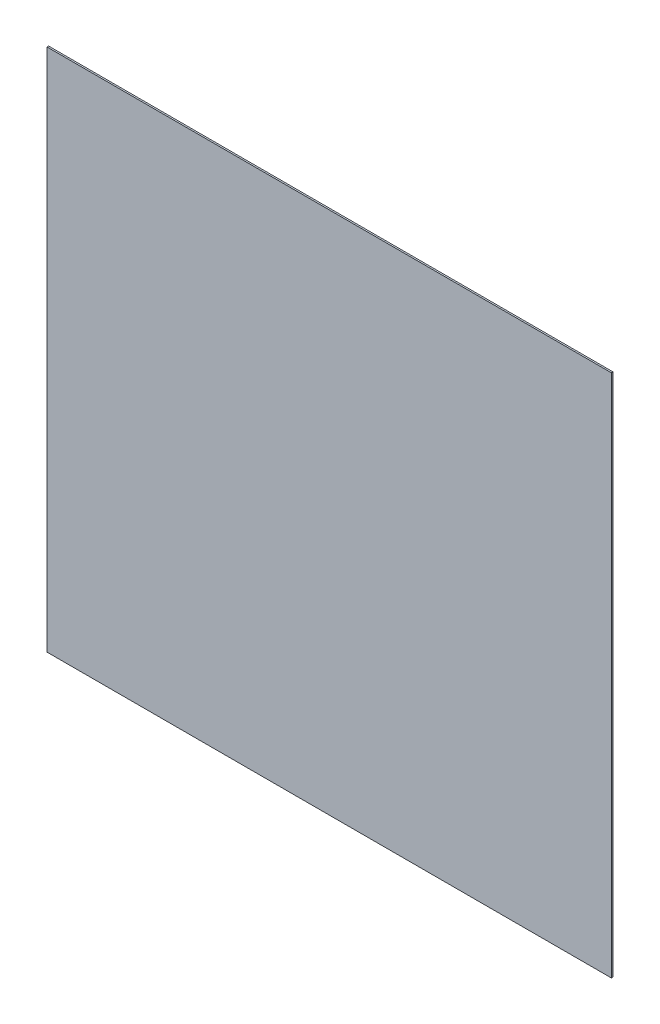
ISO-10303-21;
HEADER;
FILE_DESCRIPTION(('STEP AP214'),'2;1');
FILE_NAME('part.step','',(''),(''),'','','');
FILE_SCHEMA(('AUTOMOTIVE_DESIGN { 1 0 10303 214 1 1 1 1 }'));
ENDSEC;
DATA;
#1=APPLICATION_CONTEXT('core data for automotive mechanical design processes');
#2=APPLICATION_PROTOCOL_DEFINITION('international standard','automotive_design',2000,#1);
#3=PRODUCT_CONTEXT('',#1,'mechanical');
#4=PRODUCT('Part','Part','',(#3));
#5=PRODUCT_RELATED_PRODUCT_CATEGORY('part','',(#4));
#6=PRODUCT_DEFINITION_FORMATION('','',#4);
#7=PRODUCT_DEFINITION_CONTEXT('part definition',#1,'design');
#8=PRODUCT_DEFINITION('design','',#6,#7);
#9=PRODUCT_DEFINITION_SHAPE('','',#8);
#10=(LENGTH_UNIT() NAMED_UNIT(*) SI_UNIT(.MILLI.,.METRE.));
#11=(NAMED_UNIT(*) PLANE_ANGLE_UNIT() SI_UNIT($,.RADIAN.));
#12=(NAMED_UNIT(*) SI_UNIT($,.STERADIAN.) SOLID_ANGLE_UNIT());
#13=UNCERTAINTY_MEASURE_WITH_UNIT(LENGTH_MEASURE(1.E-05),#10,'distance_accuracy_value','');
#14=(GEOMETRIC_REPRESENTATION_CONTEXT(3) GLOBAL_UNCERTAINTY_ASSIGNED_CONTEXT((#13)) GLOBAL_UNIT_ASSIGNED_CONTEXT((#10,
#11,#12)) REPRESENTATION_CONTEXT('',''));
#15=CARTESIAN_POINT('',(0.,0.,0.));
#16=DIRECTION('',(0.,0.,1.));
#17=DIRECTION('',(1.,0.,0.));
#18=AXIS2_PLACEMENT_3D('',#15,#16,#17);
#19=CARTESIAN_POINT('',(0.,0.,2.));
#20=DIRECTION('',(1.,0.,0.));
#21=DIRECTION('',(0.,0.,-1.));
#22=AXIS2_PLACEMENT_3D('',#19,#20,#21);
#23=PLANE('',#22);
#24=DIRECTION('',(0.,-1.,0.));
#25=VECTOR('',#24,1.);
#26=CARTESIAN_POINT('',(0.,0.,0.));
#27=LINE('',#26,#25);
#28=CARTESIAN_POINT('',(0.,650.,0.));
#29=VERTEX_POINT('',#28);
#30=CARTESIAN_POINT('',(0.,0.,0.));
#31=VERTEX_POINT('',#30);
#32=EDGE_CURVE('E95',#29,#31,#27,.T.);
#33=ORIENTED_EDGE('',*,*,#32,.T.);
#34=DIRECTION('',(0.,0.,-1.));
#35=VECTOR('',#34,1.);
#36=CARTESIAN_POINT('',(0.,0.,2.));
#37=LINE('',#36,#35);
#38=CARTESIAN_POINT('',(0.,0.,2.));
#39=VERTEX_POINT('',#38);
#40=EDGE_CURVE('E11',#39,#31,#37,.T.);
#41=ORIENTED_EDGE('',*,*,#40,.F.);
#42=DIRECTION('',(0.,-1.,0.));
#43=VECTOR('',#42,1.);
#44=CARTESIAN_POINT('',(0.,0.,2.));
#45=LINE('',#44,#43);
#46=CARTESIAN_POINT('',(0.,650.,2.));
#47=VERTEX_POINT('',#46);
#48=EDGE_CURVE('E83',#47,#39,#45,.T.);
#49=ORIENTED_EDGE('',*,*,#48,.F.);
#50=DIRECTION('',(0.,0.,-1.));
#51=VECTOR('',#50,1.);
#52=CARTESIAN_POINT('',(0.,650.,2.));
#53=LINE('',#52,#51);
#54=EDGE_CURVE('E91',#47,#29,#53,.T.);
#55=ORIENTED_EDGE('',*,*,#54,.T.);
#56=EDGE_LOOP('',(#33,#41,#49,#55));
#57=FACE_BOUND('',#56,.T.);
#58=ADVANCED_FACE('F32',(#57),#23,.F.);
#59=CARTESIAN_POINT('',(0.,0.,2.));
#60=DIRECTION('',(0.,1.,0.));
#61=DIRECTION('',(0.,0.,1.));
#62=AXIS2_PLACEMENT_3D('',#59,#60,#61);
#63=PLANE('',#62);
#64=DIRECTION('',(1.,0.,0.));
#65=VECTOR('',#64,1.);
#66=CARTESIAN_POINT('',(0.,0.,0.));
#67=LINE('',#66,#65);
#68=CARTESIAN_POINT('',(700.,0.,0.));
#69=VERTEX_POINT('',#68);
#70=EDGE_CURVE('E87',#31,#69,#67,.T.);
#71=ORIENTED_EDGE('',*,*,#70,.T.);
#72=DIRECTION('',(0.,0.,-1.));
#73=VECTOR('',#72,1.);
#74=CARTESIAN_POINT('',(700.,0.,2.));
#75=LINE('',#74,#73);
#76=CARTESIAN_POINT('',(700.,0.,2.));
#77=VERTEX_POINT('',#76);
#78=EDGE_CURVE('E40',#77,#69,#75,.T.);
#79=ORIENTED_EDGE('',*,*,#78,.F.);
#80=DIRECTION('',(1.,0.,0.));
#81=VECTOR('',#80,1.);
#82=CARTESIAN_POINT('',(0.,0.,2.));
#83=LINE('',#82,#81);
#84=EDGE_CURVE('E78',#39,#77,#83,.T.);
#85=ORIENTED_EDGE('',*,*,#84,.F.);
#86=ORIENTED_EDGE('',*,*,#40,.T.);
#87=EDGE_LOOP('',(#71,#79,#85,#86));
#88=FACE_BOUND('',#87,.T.);
#89=ADVANCED_FACE('F86',(#88),#63,.F.);
#90=CARTESIAN_POINT('',(700.,0.,2.));
#91=DIRECTION('',(-1.,0.,0.));
#92=DIRECTION('',(0.,0.,1.));
#93=AXIS2_PLACEMENT_3D('',#90,#91,#92);
#94=PLANE('',#93);
#95=DIRECTION('',(0.,1.,0.));
#96=VECTOR('',#95,1.);
#97=CARTESIAN_POINT('',(700.,0.,0.));
#98=LINE('',#97,#96);
#99=CARTESIAN_POINT('',(700.,650.,0.));
#100=VERTEX_POINT('',#99);
#101=EDGE_CURVE('E65',#69,#100,#98,.T.);
#102=ORIENTED_EDGE('',*,*,#101,.T.);
#103=DIRECTION('',(0.,0.,-1.));
#104=VECTOR('',#103,1.);
#105=CARTESIAN_POINT('',(700.,650.,2.));
#106=LINE('',#105,#104);
#107=CARTESIAN_POINT('',(700.,650.,2.));
#108=VERTEX_POINT('',#107);
#109=EDGE_CURVE('E88',#108,#100,#106,.T.);
#110=ORIENTED_EDGE('',*,*,#109,.F.);
#111=DIRECTION('',(0.,1.,0.));
#112=VECTOR('',#111,1.);
#113=CARTESIAN_POINT('',(700.,0.,2.));
#114=LINE('',#113,#112);
#115=EDGE_CURVE('E81',#77,#108,#114,.T.);
#116=ORIENTED_EDGE('',*,*,#115,.F.);
#117=ORIENTED_EDGE('',*,*,#78,.T.);
#118=EDGE_LOOP('',(#102,#110,#116,#117));
#119=FACE_BOUND('',#118,.T.);
#120=ADVANCED_FACE('F89',(#119),#94,.F.);
#121=CARTESIAN_POINT('',(0.,650.,2.));
#122=DIRECTION('',(0.,-1.,0.));
#123=DIRECTION('',(0.,0.,-1.));
#124=AXIS2_PLACEMENT_3D('',#121,#122,#123);
#125=PLANE('',#124);
#126=DIRECTION('',(-1.,0.,0.));
#127=VECTOR('',#126,1.);
#128=CARTESIAN_POINT('',(0.,650.,0.));
#129=LINE('',#128,#127);
#130=EDGE_CURVE('E71',#100,#29,#129,.T.);
#131=ORIENTED_EDGE('',*,*,#130,.T.);
#132=ORIENTED_EDGE('',*,*,#54,.F.);
#133=DIRECTION('',(-1.,0.,0.));
#134=VECTOR('',#133,1.);
#135=CARTESIAN_POINT('',(0.,650.,2.));
#136=LINE('',#135,#134);
#137=EDGE_CURVE('E48',#108,#47,#136,.T.);
#138=ORIENTED_EDGE('',*,*,#137,.F.);
#139=ORIENTED_EDGE('',*,*,#109,.T.);
#140=EDGE_LOOP('',(#131,#132,#138,#139));
#141=FACE_BOUND('',#140,.T.);
#142=ADVANCED_FACE('F102',(#141),#125,.F.);
#143=CARTESIAN_POINT('',(0.,650.,2.));
#144=DIRECTION('',(0.,0.,-1.));
#145=DIRECTION('',(-1.,0.,0.));
#146=AXIS2_PLACEMENT_3D('',#143,#144,#145);
#147=PLANE('',#146);
#148=ORIENTED_EDGE('',*,*,#48,.T.);
#149=ORIENTED_EDGE('',*,*,#84,.T.);
#150=ORIENTED_EDGE('',*,*,#115,.T.);
#151=ORIENTED_EDGE('',*,*,#137,.T.);
#152=EDGE_LOOP('',(#148,#149,#150,#151));
#153=FACE_BOUND('',#152,.T.);
#154=ADVANCED_FACE('F79',(#153),#147,.F.);
#155=CARTESIAN_POINT('',(0.,650.,0.));
#156=DIRECTION('',(0.,0.,-1.));
#157=DIRECTION('',(-1.,0.,0.));
#158=AXIS2_PLACEMENT_3D('',#155,#156,#157);
#159=PLANE('',#158);
#160=ORIENTED_EDGE('',*,*,#32,.F.);
#161=ORIENTED_EDGE('',*,*,#130,.F.);
#162=ORIENTED_EDGE('',*,*,#101,.F.);
#163=ORIENTED_EDGE('',*,*,#70,.F.);
#164=EDGE_LOOP('',(#160,#161,#162,#163));
#165=FACE_BOUND('',#164,.T.);
#166=ADVANCED_FACE('F105',(#165),#159,.T.);
#167=CLOSED_SHELL('',(#58,#89,#120,#142,#154,#166));
#168=MANIFOLD_SOLID_BREP('B2',#167);
#169=ADVANCED_BREP_SHAPE_REPRESENTATION('',(#18,#168),#14);
#170=SHAPE_DEFINITION_REPRESENTATION(#9,#169);
ENDSEC;
END-ISO-10303-21;
